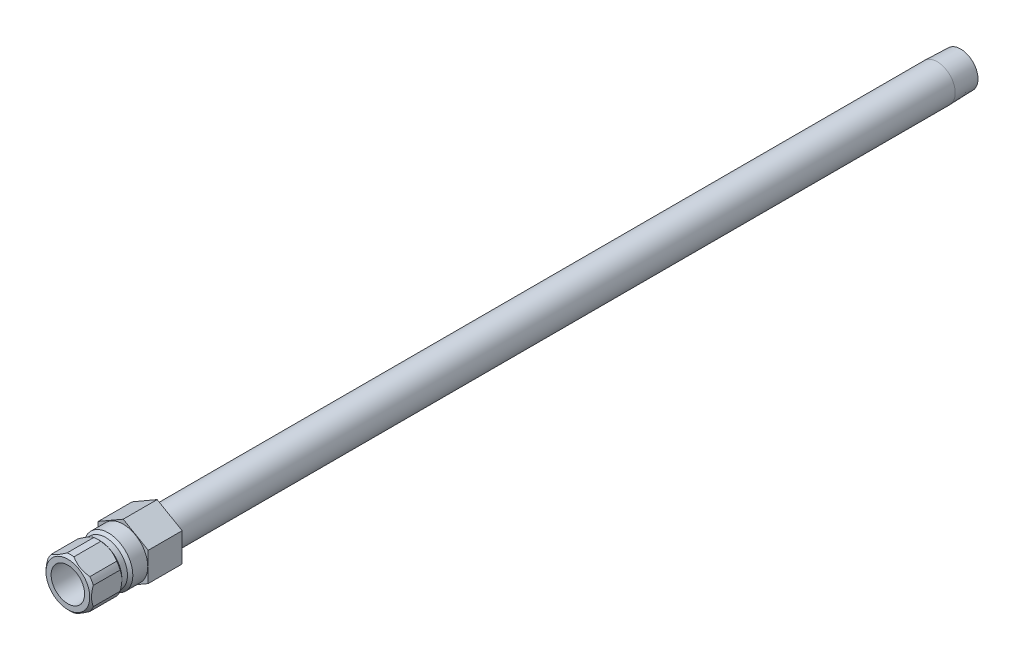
from build123d import *

# Parameters (mm, degrees)
SKETCH2_R           = 4.7625
BOSS_EXTRUDE1_DEPTH = 9.652
CUT_EXTRUDE1_START  = 6.604
SKETCH3_OUTSIDE_W   = 67.21
SKETCH3_OUTSIDE_H   = 69.41
CUT_EXTRUDE1_DEPTH  = 232.895552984


with BuildPart() as part:
    # Sketch1 → Revolve1 (revolve)
    with BuildSketch(Plane(origin=(0, 0, 0), x_dir=(0, 0, -1), z_dir=(1, 0, 0))):
        Polygon((-15.748, 4.7625), (-15.748, 6.223), (-14.986, 6.985), (-7.366, 6.985), (-6.604, 6.223), (-5.0165, 6.223), (-4.2545, 6.985), (9.652, 6.985), (9.652, 5.1435), (231.5718, 5.1435), (238.252, 4.934744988), (238.252, 3.4163), (-2.840212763, 3.4163), (-3.556, 4.7625), align=None)
    revolve(axis=Axis((0, 0, -9.652), (0, 0, 1)))

    # Sketch2 → Boss-Extrude1 (add)
    with BuildSketch(Plane.XY):
        Polygon((-7.112, 4.106115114), (-7.112, -4.106115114), (0, -8.212230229), (7.112, -4.106115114), (7.112, 4.106115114), (0, 8.212230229), align=None)
        with Locations(Location((0, 0, 0), (0, 0, 90))):
            Circle(SKETCH2_R, mode=Mode.SUBTRACT)
    extrude(amount=-BOSS_EXTRUDE1_DEPTH)

    # Sketch3 outside → Cut-Extrude1 (cut, through all)
    with BuildSketch(Plane.XY.offset(CUT_EXTRUDE1_START)):
        Rectangle(SKETCH3_OUTSIDE_W, SKETCH3_OUTSIDE_H)
        Polygon((6.477, 3.739497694), (0, 7.478995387), (-6.477, 3.739497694), (-6.477, -3.739497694), (0, -7.478995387), (6.477, -3.739497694), align=None, mode=Mode.SUBTRACT)
    extrude(amount=CUT_EXTRUDE1_DEPTH, mode=Mode.SUBTRACT)


solid = part.part
